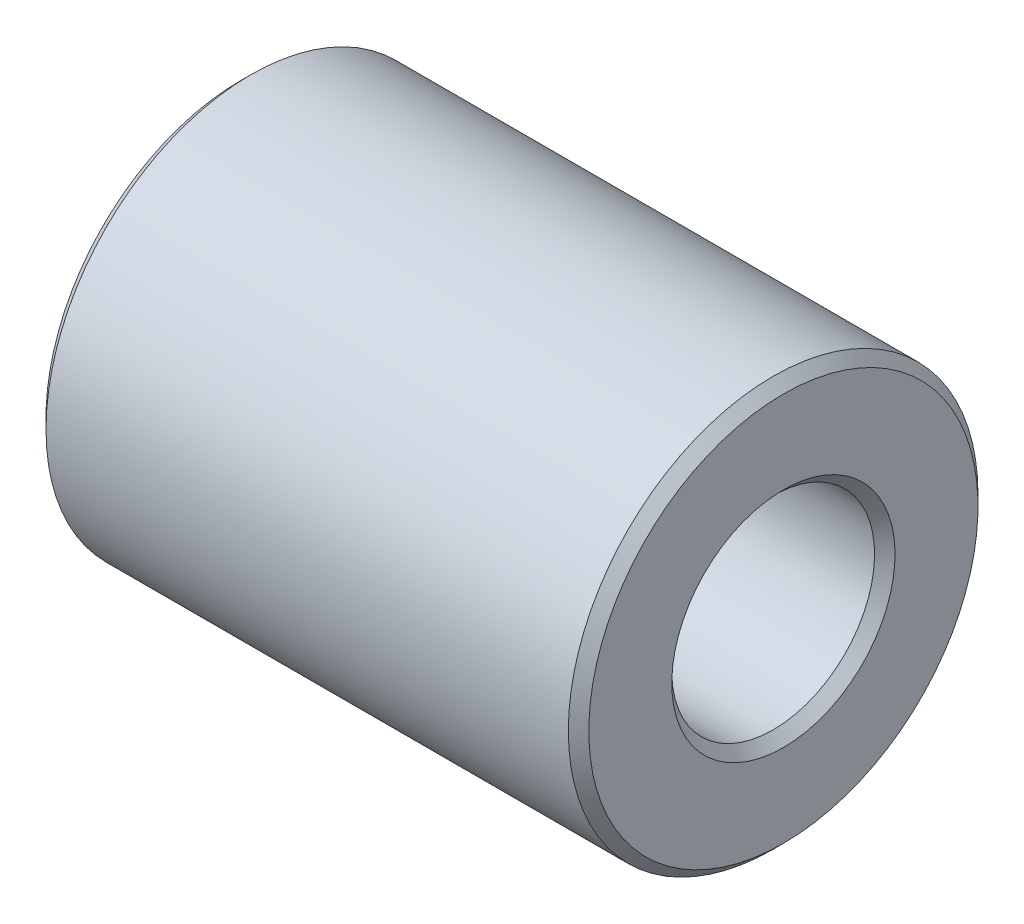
ISO-10303-21;
HEADER;
FILE_DESCRIPTION(('STEP AP214'),'2;1');
FILE_NAME('part.step','',(''),(''),'','','');
FILE_SCHEMA(('AUTOMOTIVE_DESIGN { 1 0 10303 214 1 1 1 1 }'));
ENDSEC;
DATA;
#1=APPLICATION_CONTEXT('core data for automotive mechanical design processes');
#2=APPLICATION_PROTOCOL_DEFINITION('international standard','automotive_design',2000,#1);
#3=PRODUCT_CONTEXT('',#1,'mechanical');
#4=PRODUCT('Part','Part','',(#3));
#5=PRODUCT_RELATED_PRODUCT_CATEGORY('part','',(#4));
#6=PRODUCT_DEFINITION_FORMATION('','',#4);
#7=PRODUCT_DEFINITION_CONTEXT('part definition',#1,'design');
#8=PRODUCT_DEFINITION('design','',#6,#7);
#9=PRODUCT_DEFINITION_SHAPE('','',#8);
#10=(LENGTH_UNIT() NAMED_UNIT(*) SI_UNIT(.MILLI.,.METRE.));
#11=(NAMED_UNIT(*) PLANE_ANGLE_UNIT() SI_UNIT($,.RADIAN.));
#12=(NAMED_UNIT(*) SI_UNIT($,.STERADIAN.) SOLID_ANGLE_UNIT());
#13=UNCERTAINTY_MEASURE_WITH_UNIT(LENGTH_MEASURE(1.E-05),#10,'distance_accuracy_value','');
#14=(GEOMETRIC_REPRESENTATION_CONTEXT(3) GLOBAL_UNCERTAINTY_ASSIGNED_CONTEXT((#13)) GLOBAL_UNIT_ASSIGNED_CONTEXT((#10,
#11,#12)) REPRESENTATION_CONTEXT('',''));
#15=CARTESIAN_POINT('',(0.,0.,0.));
#16=DIRECTION('',(0.,0.,1.));
#17=DIRECTION('',(1.,0.,0.));
#18=AXIS2_PLACEMENT_3D('',#15,#16,#17);
#19=CARTESIAN_POINT('',(0.500000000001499,0.,0.));
#20=DIRECTION('',(1.,0.,0.));
#21=DIRECTION('',(0.,1.,0.));
#22=AXIS2_PLACEMENT_3D('',#19,#20,#21);
#23=CONICAL_SURFACE('',#22,10.0000000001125,0.785398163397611);
#24=CARTESIAN_POINT('',(0.,0.,0.));
#25=DIRECTION('',(-1.,0.,0.));
#26=DIRECTION('',(0.,-1.,0.));
#27=AXIS2_PLACEMENT_3D('',#24,#25,#26);
#28=CIRCLE('',#27,9.50000000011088);
#29=CARTESIAN_POINT('',(0.,-9.50000000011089,0.));
#30=VERTEX_POINT('',#29);
#31=EDGE_CURVE('E10',#30,#30,#28,.T.);
#32=ORIENTED_EDGE('',*,*,#31,.F.);
#33=EDGE_LOOP('',(#32));
#34=FACE_BOUND('',#33,.T.);
#35=CARTESIAN_POINT('',(0.500000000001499,0.,0.));
#36=DIRECTION('',(-1.,0.,0.));
#37=DIRECTION('',(0.,-1.,0.));
#38=AXIS2_PLACEMENT_3D('',#35,#36,#37);
#39=CIRCLE('',#38,10.0000000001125);
#40=CARTESIAN_POINT('',(0.5000000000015,-10.0000000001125,0.));
#41=VERTEX_POINT('',#40);
#42=EDGE_CURVE('E58',#41,#41,#39,.T.);
#43=ORIENTED_EDGE('',*,*,#42,.T.);
#44=EDGE_LOOP('',(#43));
#45=FACE_BOUND('',#44,.T.);
#46=ADVANCED_FACE('F30',(#34,#45),#23,.T.);
#47=CARTESIAN_POINT('',(0.,9.50000000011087,0.));
#48=DIRECTION('',(1.,0.,0.));
#49=DIRECTION('',(0.,1.,0.));
#50=AXIS2_PLACEMENT_3D('',#47,#48,#49);
#51=PLANE('',#50);
#52=CARTESIAN_POINT('',(0.,0.,0.));
#53=DIRECTION('',(-1.,0.,0.));
#54=DIRECTION('',(0.,-1.,0.));
#55=AXIS2_PLACEMENT_3D('',#52,#53,#54);
#56=CIRCLE('',#55,5.44999999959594);
#57=CARTESIAN_POINT('',(0.,-5.44999999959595,0.));
#58=VERTEX_POINT('',#57);
#59=EDGE_CURVE('E36',#58,#58,#56,.T.);
#60=ORIENTED_EDGE('',*,*,#59,.F.);
#61=EDGE_LOOP('',(#60));
#62=FACE_BOUND('',#61,.T.);
#63=ORIENTED_EDGE('',*,*,#31,.T.);
#64=EDGE_LOOP('',(#63));
#65=FACE_BOUND('',#64,.T.);
#66=ADVANCED_FACE('F95',(#62,#65),#51,.F.);
#67=CARTESIAN_POINT('',(0.,0.,0.));
#68=DIRECTION('',(-1.,0.,0.));
#69=DIRECTION('',(0.,-1.,0.));
#70=AXIS2_PLACEMENT_3D('',#67,#68,#69);
#71=CONICAL_SURFACE('',#70,5.44999999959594,0.785398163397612);
#72=CARTESIAN_POINT('',(0.500000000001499,0.,0.));
#73=DIRECTION('',(-1.,0.,0.));
#74=DIRECTION('',(0.,-1.,0.));
#75=AXIS2_PLACEMENT_3D('',#72,#73,#74);
#76=CIRCLE('',#75,4.94999999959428);
#77=CARTESIAN_POINT('',(0.5000000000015,-4.94999999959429,0.));
#78=VERTEX_POINT('',#77);
#79=EDGE_CURVE('E40',#78,#78,#76,.T.);
#80=ORIENTED_EDGE('',*,*,#79,.F.);
#81=EDGE_LOOP('',(#80));
#82=FACE_BOUND('',#81,.T.);
#83=ORIENTED_EDGE('',*,*,#59,.T.);
#84=EDGE_LOOP('',(#83));
#85=FACE_BOUND('',#84,.T.);
#86=ADVANCED_FACE('F90',(#82,#85),#71,.F.);
#87=CARTESIAN_POINT('',(36.8384895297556,0.,0.));
#88=DIRECTION('',(-1.,0.,0.));
#89=DIRECTION('',(0.,-1.,0.));
#90=AXIS2_PLACEMENT_3D('',#87,#88,#89);
#91=CYLINDRICAL_SURFACE('',#90,4.94999999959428);
#92=CARTESIAN_POINT('',(25.9999999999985,0.,0.));
#93=DIRECTION('',(-1.,0.,0.));
#94=DIRECTION('',(0.,-1.,0.));
#95=AXIS2_PLACEMENT_3D('',#92,#93,#94);
#96=CIRCLE('',#95,4.94999999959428);
#97=CARTESIAN_POINT('',(25.9999999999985,-4.94999999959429,0.));
#98=VERTEX_POINT('',#97);
#99=EDGE_CURVE('E44',#98,#98,#96,.T.);
#100=ORIENTED_EDGE('',*,*,#99,.F.);
#101=EDGE_LOOP('',(#100));
#102=FACE_BOUND('',#101,.T.);
#103=ORIENTED_EDGE('',*,*,#79,.T.);
#104=EDGE_LOOP('',(#103));
#105=FACE_BOUND('',#104,.T.);
#106=ADVANCED_FACE('F84',(#102,#105),#91,.F.);
#107=CARTESIAN_POINT('',(25.9999999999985,0.,0.));
#108=DIRECTION('',(1.,0.,0.));
#109=DIRECTION('',(0.,1.,0.));
#110=AXIS2_PLACEMENT_3D('',#107,#108,#109);
#111=CONICAL_SURFACE('',#110,4.94999999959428,0.785398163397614);
#112=CARTESIAN_POINT('',(26.5,0.,0.));
#113=DIRECTION('',(-1.,0.,0.));
#114=DIRECTION('',(0.,-1.,0.));
#115=AXIS2_PLACEMENT_3D('',#112,#113,#114);
#116=CIRCLE('',#115,5.44999999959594);
#117=CARTESIAN_POINT('',(26.5,-5.44999999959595,0.));
#118=VERTEX_POINT('',#117);
#119=EDGE_CURVE('E49',#118,#118,#116,.T.);
#120=ORIENTED_EDGE('',*,*,#119,.F.);
#121=EDGE_LOOP('',(#120));
#122=FACE_BOUND('',#121,.T.);
#123=ORIENTED_EDGE('',*,*,#99,.T.);
#124=EDGE_LOOP('',(#123));
#125=FACE_BOUND('',#124,.T.);
#126=ADVANCED_FACE('F78',(#122,#125),#111,.F.);
#127=CARTESIAN_POINT('',(26.5,5.44999999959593,0.));
#128=DIRECTION('',(-1.,0.,0.));
#129=DIRECTION('',(0.,-1.,0.));
#130=AXIS2_PLACEMENT_3D('',#127,#128,#129);
#131=PLANE('',#130);
#132=CARTESIAN_POINT('',(26.5,0.,0.));
#133=DIRECTION('',(-1.,0.,0.));
#134=DIRECTION('',(0.,-1.,0.));
#135=AXIS2_PLACEMENT_3D('',#132,#133,#134);
#136=CIRCLE('',#135,9.50000000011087);
#137=CARTESIAN_POINT('',(26.5,-9.50000000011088,0.));
#138=VERTEX_POINT('',#137);
#139=EDGE_CURVE('E52',#138,#138,#136,.T.);
#140=ORIENTED_EDGE('',*,*,#139,.F.);
#141=EDGE_LOOP('',(#140));
#142=FACE_BOUND('',#141,.T.);
#143=ORIENTED_EDGE('',*,*,#119,.T.);
#144=EDGE_LOOP('',(#143));
#145=FACE_BOUND('',#144,.T.);
#146=ADVANCED_FACE('F72',(#142,#145),#131,.F.);
#147=CARTESIAN_POINT('',(26.5,0.,0.));
#148=DIRECTION('',(-1.,0.,0.));
#149=DIRECTION('',(0.,-1.,0.));
#150=AXIS2_PLACEMENT_3D('',#147,#148,#149);
#151=CONICAL_SURFACE('',#150,9.50000000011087,0.785398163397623);
#152=CARTESIAN_POINT('',(25.9999999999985,0.,0.));
#153=DIRECTION('',(-1.,0.,0.));
#154=DIRECTION('',(0.,-1.,0.));
#155=AXIS2_PLACEMENT_3D('',#152,#153,#154);
#156=CIRCLE('',#155,10.0000000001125);
#157=CARTESIAN_POINT('',(25.9999999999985,-10.0000000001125,0.));
#158=VERTEX_POINT('',#157);
#159=EDGE_CURVE('E55',#158,#158,#156,.T.);
#160=ORIENTED_EDGE('',*,*,#159,.F.);
#161=EDGE_LOOP('',(#160));
#162=FACE_BOUND('',#161,.T.);
#163=ORIENTED_EDGE('',*,*,#139,.T.);
#164=EDGE_LOOP('',(#163));
#165=FACE_BOUND('',#164,.T.);
#166=ADVANCED_FACE('F66',(#162,#165),#151,.T.);
#167=CARTESIAN_POINT('',(36.8384895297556,0.,0.));
#168=DIRECTION('',(-1.,0.,0.));
#169=DIRECTION('',(0.,-1.,0.));
#170=AXIS2_PLACEMENT_3D('',#167,#168,#169);
#171=CYLINDRICAL_SURFACE('',#170,10.0000000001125);
#172=ORIENTED_EDGE('',*,*,#42,.F.);
#173=EDGE_LOOP('',(#172));
#174=FACE_BOUND('',#173,.T.);
#175=ORIENTED_EDGE('',*,*,#159,.T.);
#176=EDGE_LOOP('',(#175));
#177=FACE_BOUND('',#176,.T.);
#178=ADVANCED_FACE('F63',(#174,#177),#171,.T.);
#179=CLOSED_SHELL('',(#46,#66,#86,#106,#126,#146,#166,#178));
#180=MANIFOLD_SOLID_BREP('B2',#179);
#181=ADVANCED_BREP_SHAPE_REPRESENTATION('',(#18,#180),#14);
#182=SHAPE_DEFINITION_REPRESENTATION(#9,#181);
ENDSEC;
END-ISO-10303-21;
